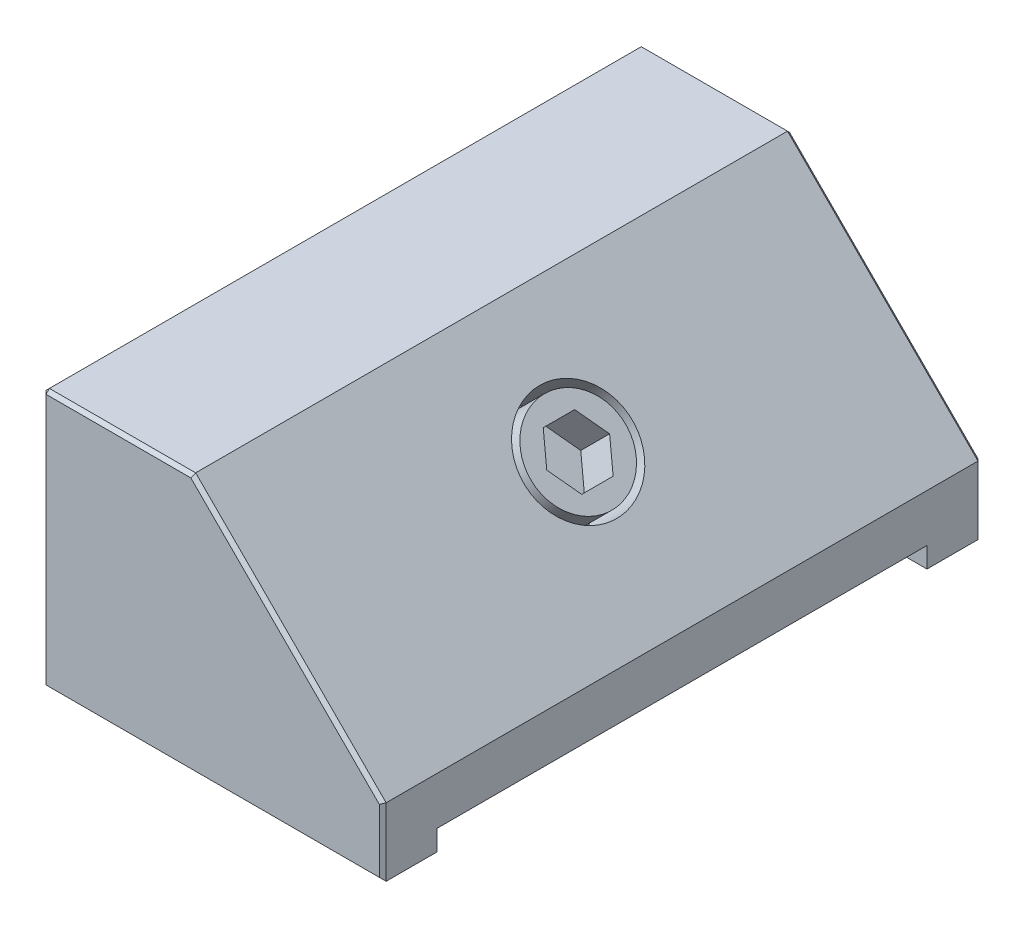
from build123d import *

# Parameters (mm, degrees)
EXTRUSION1_DEPTH        = 44
ESQUISSE2_W             = 50
ESQUISSE2_H             = 72
ENL_V_MAT_EXTRU_1_DEPTH = 3
CHANFREIN1_SIZE         = 0.5
ESQUISSE3_R             = 8
ENL_V_MAT_EXTRU_2_DEPTH = 10
ESQUISSE4_R             = 7
EXTRUSION2_DEPTH        = 10
ENL_V_MAT_EXTRU_3_DEPTH = 6


with BuildPart() as part:
    # Esquisse1 → Extrusion1 (new, symmetric)
    with BuildSketch(Plane.XY):
        Polygon((0, 0), (0, 38), (22, 38), (50, 10), (50, 0), align=None)
    extrude(amount=EXTRUSION1_DEPTH, both=True)

    # Esquisse2 → Enl_v. mat.-Extru.1 (cut)
    with BuildSketch(Plane.XZ):
        with Locations((25, 0)):
            Rectangle(ESQUISSE2_W, ESQUISSE2_H)
    extrude(amount=-ENL_V_MAT_EXTRU_1_DEPTH, mode=Mode.SUBTRACT)

    # Chanfrein1
    chanfrein1_edges = [part.edges().sort_by_distance(p)[0] for p in [
        (36, 24, 44),
        (11, 38, 44),
        (0, 19, 44),
        (25, 0, 44),
        (0, 19, -44),
        (11, 38, -44),
        (36, 24, -44),
        (50, 5, -44),
        (25, 0, -44),
        (50, 5, 44),
        (0, 38, 0),
    ]]
    chamfer(chanfrein1_edges, length=CHANFREIN1_SIZE)

    # Esquisse3 → Enl_v. mat.-Extru.2 (cut)
    with BuildSketch(Plane(origin=(30, 30, 0), x_dir=(-0.7071067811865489, 0.7071067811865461, 0), z_dir=(0.7071067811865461, 0.7071067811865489, 0))):
        with Locations((-6.686291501, 0)):
            Circle(ESQUISSE3_R)
    extrude(amount=-ENL_V_MAT_EXTRU_2_DEPTH, mode=Mode.SUBTRACT)

    # Esquisse4 → Extrusion2 (add)
    with BuildSketch(Plane(origin=(22.928932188, 22.928932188, 0), x_dir=(-0.7071067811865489, 0.7071067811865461, 0), z_dir=(0.7071067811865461, 0.7071067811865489, 0))):
        with Locations((-6.686291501, 0)):
            Circle(ESQUISSE4_R)
    extrude(amount=EXTRUSION2_DEPTH)

    # Esquisse5 → Enl_v. mat.-Extru.3 (cut)
    with BuildSketch(Plane(origin=(30, 30, 0), x_dir=(-0.7071067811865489, 0.7071067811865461, 0), z_dir=(0.7071067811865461, 0.7071067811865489, 0))):
        Polygon((-2.686291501, -2.309401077), (-2.686291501, 2.309401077), (-6.686291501, 4.618802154), (-10.686291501, 2.309401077), (-10.686291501, -2.309401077), (-6.686291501, -4.618802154), align=None)
    extrude(amount=-ENL_V_MAT_EXTRU_3_DEPTH, mode=Mode.SUBTRACT)


solid = part.part
